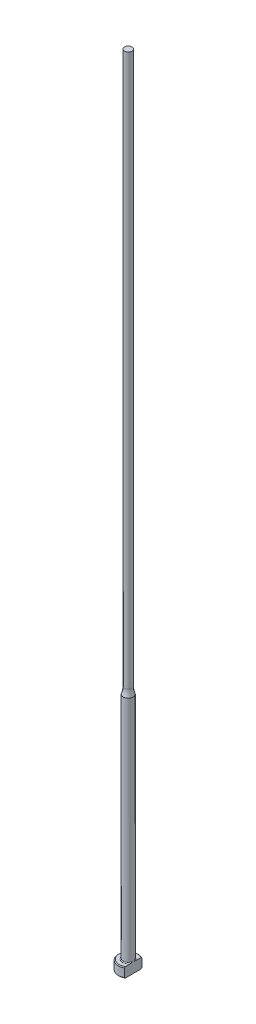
ISO-10303-21;
HEADER;
FILE_DESCRIPTION(('STEP AP214'),'2;1');
FILE_NAME('part.step','',(''),(''),'','','');
FILE_SCHEMA(('AUTOMOTIVE_DESIGN { 1 0 10303 214 1 1 1 1 }'));
ENDSEC;
DATA;
#1=APPLICATION_CONTEXT('core data for automotive mechanical design processes');
#2=APPLICATION_PROTOCOL_DEFINITION('international standard','automotive_design',2000,#1);
#3=PRODUCT_CONTEXT('',#1,'mechanical');
#4=PRODUCT('Part','Part','',(#3));
#5=PRODUCT_RELATED_PRODUCT_CATEGORY('part','',(#4));
#6=PRODUCT_DEFINITION_FORMATION('','',#4);
#7=PRODUCT_DEFINITION_CONTEXT('part definition',#1,'design');
#8=PRODUCT_DEFINITION('design','',#6,#7);
#9=PRODUCT_DEFINITION_SHAPE('','',#8);
#10=(LENGTH_UNIT() NAMED_UNIT(*) SI_UNIT(.MILLI.,.METRE.));
#11=(NAMED_UNIT(*) PLANE_ANGLE_UNIT() SI_UNIT($,.RADIAN.));
#12=(NAMED_UNIT(*) SI_UNIT($,.STERADIAN.) SOLID_ANGLE_UNIT());
#13=UNCERTAINTY_MEASURE_WITH_UNIT(LENGTH_MEASURE(1.E-05),#10,'distance_accuracy_value','');
#14=(GEOMETRIC_REPRESENTATION_CONTEXT(3) GLOBAL_UNCERTAINTY_ASSIGNED_CONTEXT((#13)) GLOBAL_UNIT_ASSIGNED_CONTEXT((#10,
#11,#12)) REPRESENTATION_CONTEXT('',''));
#15=CARTESIAN_POINT('',(0.,0.,0.));
#16=DIRECTION('',(0.,0.,1.));
#17=DIRECTION('',(1.,0.,0.));
#18=AXIS2_PLACEMENT_3D('',#15,#16,#17);
#19=CARTESIAN_POINT('',(-3.17499999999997,3.175,0.));
#20=DIRECTION('',(0.,1.,0.));
#21=DIRECTION('',(0.,0.,1.));
#22=AXIS2_PLACEMENT_3D('',#19,#20,#21);
#23=PLANE('',#22);
#24=CARTESIAN_POINT('',(0.,3.175,0.));
#25=DIRECTION('',(0.,1.,0.));
#26=DIRECTION('',(0.,0.,1.));
#27=AXIS2_PLACEMENT_3D('',#24,#25,#26);
#28=CIRCLE('',#27,2.92099999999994);
#29=CARTESIAN_POINT('',(1.58749999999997,3.175,-2.45195529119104));
#30=VERTEX_POINT('',#29);
#31=CARTESIAN_POINT('',(1.58749999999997,3.175,2.45195529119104));
#32=VERTEX_POINT('',#31);
#33=EDGE_CURVE('E105',#30,#32,#28,.T.);
#34=ORIENTED_EDGE('',*,*,#33,.T.);
#35=DIRECTION('',(0.,0.,1.));
#36=VECTOR('',#35,1.);
#37=CARTESIAN_POINT('',(1.58749999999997,3.17499999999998,2.74963065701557));
#38=LINE('',#37,#36);
#39=CARTESIAN_POINT('',(1.58749999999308,3.175,0.933255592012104));
#40=VERTEX_POINT('',#39);
#41=EDGE_CURVE('E126',#40,#32,#38,.T.);
#42=ORIENTED_EDGE('',*,*,#41,.F.);
#43=CARTESIAN_POINT('',(0.,3.175,0.));
#44=DIRECTION('',(0.,1.,0.));
#45=DIRECTION('',(0.,0.,1.));
#46=AXIS2_PLACEMENT_3D('',#43,#44,#45);
#47=CIRCLE('',#46,1.84149999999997);
#48=CARTESIAN_POINT('',(1.58749999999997,3.17500000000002,-0.933255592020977));
#49=VERTEX_POINT('',#48);
#50=EDGE_CURVE('E11',#40,#49,#47,.F.);
#51=ORIENTED_EDGE('',*,*,#50,.T.);
#52=EDGE_CURVE('E52',#30,#49,#38,.T.);
#53=ORIENTED_EDGE('',*,*,#52,.F.);
#54=EDGE_LOOP('',(#34,#42,#51,#53));
#55=FACE_BOUND('',#54,.T.);
#56=ADVANCED_FACE('F32',(#55),#23,.T.);
#57=CARTESIAN_POINT('',(0.,259.958771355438,0.));
#58=DIRECTION('',(0.,1.,0.));
#59=DIRECTION('',(0.,0.,1.));
#60=AXIS2_PLACEMENT_3D('',#57,#58,#59);
#61=CYLINDRICAL_SURFACE('',#60,3.17499999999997);
#62=CARTESIAN_POINT('',(0.,2.92100000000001,0.));
#63=DIRECTION('',(0.,1.,0.));
#64=DIRECTION('',(0.,0.,1.));
#65=AXIS2_PLACEMENT_3D('',#62,#63,#64);
#66=CIRCLE('',#65,3.17499999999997);
#67=CARTESIAN_POINT('',(1.58749999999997,2.92100000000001,2.74963065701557));
#68=VERTEX_POINT('',#67);
#69=CARTESIAN_POINT('',(1.58749999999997,2.92100000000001,-2.74963065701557));
#70=VERTEX_POINT('',#69);
#71=EDGE_CURVE('E98',#68,#70,#66,.F.);
#72=ORIENTED_EDGE('',*,*,#71,.T.);
#73=DIRECTION('',(0.,-1.,0.));
#74=VECTOR('',#73,1.);
#75=CARTESIAN_POINT('',(1.58749999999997,254.001,-2.74963065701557));
#76=LINE('',#75,#74);
#77=CARTESIAN_POINT('',(1.58749999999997,0.253999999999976,-2.74963065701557));
#78=VERTEX_POINT('',#77);
#79=EDGE_CURVE('E141',#70,#78,#76,.T.);
#80=ORIENTED_EDGE('',*,*,#79,.T.);
#81=CARTESIAN_POINT('',(0.,0.253999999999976,0.));
#82=DIRECTION('',(0.,-1.,0.));
#83=DIRECTION('',(0.,0.,-1.));
#84=AXIS2_PLACEMENT_3D('',#81,#82,#83);
#85=CIRCLE('',#84,3.17499999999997);
#86=CARTESIAN_POINT('',(1.58749999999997,0.253999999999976,2.74963065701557));
#87=VERTEX_POINT('',#86);
#88=EDGE_CURVE('E95',#78,#87,#85,.F.);
#89=ORIENTED_EDGE('',*,*,#88,.T.);
#90=DIRECTION('',(0.,-1.,0.));
#91=VECTOR('',#90,1.);
#92=CARTESIAN_POINT('',(1.58749999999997,254.001,2.74963065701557));
#93=LINE('',#92,#91);
#94=EDGE_CURVE('E88',#68,#87,#93,.T.);
#95=ORIENTED_EDGE('',*,*,#94,.F.);
#96=EDGE_LOOP('',(#72,#80,#89,#95));
#97=FACE_BOUND('',#96,.T.);
#98=ADVANCED_FACE('F191',(#97),#61,.T.);
#99=CARTESIAN_POINT('',(0.,0.,0.));
#100=DIRECTION('',(0.,-1.,0.));
#101=DIRECTION('',(0.,0.,-1.));
#102=AXIS2_PLACEMENT_3D('',#99,#100,#101);
#103=PLANE('',#102);
#104=CARTESIAN_POINT('',(0.,0.,0.));
#105=DIRECTION('',(0.,-1.,0.));
#106=DIRECTION('',(0.,0.,-1.));
#107=AXIS2_PLACEMENT_3D('',#104,#105,#106);
#108=CIRCLE('',#107,2.92100000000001);
#109=CARTESIAN_POINT('',(1.58749999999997,0.,2.45195529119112));
#110=VERTEX_POINT('',#109);
#111=CARTESIAN_POINT('',(1.58749999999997,0.,-2.45195529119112));
#112=VERTEX_POINT('',#111);
#113=EDGE_CURVE('E93',#110,#112,#108,.T.);
#114=ORIENTED_EDGE('',*,*,#113,.T.);
#115=DIRECTION('',(0.,0.,1.));
#116=VECTOR('',#115,1.);
#117=CARTESIAN_POINT('',(1.58749999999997,0.,2.74963065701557));
#118=LINE('',#117,#116);
#119=EDGE_CURVE('E78',#112,#110,#118,.T.);
#120=ORIENTED_EDGE('',*,*,#119,.T.);
#121=EDGE_LOOP('',(#114,#120));
#122=FACE_BOUND('',#121,.T.);
#123=ADVANCED_FACE('F97',(#122),#103,.T.);
#124=CARTESIAN_POINT('',(0.,3.17499999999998,0.));
#125=DIRECTION('',(0.,-1.,0.));
#126=DIRECTION('',(0.,0.,-1.));
#127=AXIS2_PLACEMENT_3D('',#124,#125,#126);
#128=CONICAL_SURFACE('',#127,2.92099999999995,0.785398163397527);
#129=ORIENTED_EDGE('',*,*,#71,.F.);
#130=CARTESIAN_POINT('',(1.58749999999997,-0.16162066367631,-6.0529050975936));
#131=CARTESIAN_POINT('',(1.58749999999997,-0.0288893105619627,-5.91567682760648));
#132=CARTESIAN_POINT('',(1.58749999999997,0.103699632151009,-5.7783103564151));
#133=CARTESIAN_POINT('',(1.58749999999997,0.368508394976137,-5.50321874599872));
#134=CARTESIAN_POINT('',(1.58749999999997,0.500728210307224,-5.36549360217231));
#135=CARTESIAN_POINT('',(1.58749999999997,0.764778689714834,-5.08953516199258));
#136=CARTESIAN_POINT('',(1.58749999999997,0.896609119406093,-4.9513016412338));
#137=CARTESIAN_POINT('',(1.58749999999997,1.15968706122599,-4.67428233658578));
#138=CARTESIAN_POINT('',(1.58749999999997,1.29093457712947,-4.53549655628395));
#139=CARTESIAN_POINT('',(1.58749999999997,1.55007705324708,-4.25997724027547));
#140=CARTESIAN_POINT('',(1.58749999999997,1.67798684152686,-4.12325766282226));
#141=CARTESIAN_POINT('',(1.58749999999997,1.9328486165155,-3.84892898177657));
#142=CARTESIAN_POINT('',(1.58749999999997,2.05980060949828,-3.71131988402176));
#143=CARTESIAN_POINT('',(1.58749999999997,2.31237508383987,-3.43493978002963));
#144=CARTESIAN_POINT('',(1.58749999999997,2.43799784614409,-3.29616903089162));
#145=CARTESIAN_POINT('',(1.58749999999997,2.68741369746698,-3.01699558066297));
#146=CARTESIAN_POINT('',(1.58749999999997,2.81120686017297,-2.8765929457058));
#147=CARTESIAN_POINT('',(1.58749999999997,3.00875865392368,-2.64816703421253));
#148=CARTESIAN_POINT('',(1.58749999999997,3.08336151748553,-2.56087478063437));
#149=CARTESIAN_POINT('',(1.58749999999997,3.2312387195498,-2.38515423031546));
#150=CARTESIAN_POINT('',(1.58749999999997,3.30451292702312,-2.29672582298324));
#151=CARTESIAN_POINT('',(1.58749999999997,3.45004422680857,-2.1174740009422));
#152=CARTESIAN_POINT('',(1.58749999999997,3.5222823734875,-2.02663514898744));
#153=CARTESIAN_POINT('',(1.58749999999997,3.66423097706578,-1.8430252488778));
#154=CARTESIAN_POINT('',(1.58749999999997,3.73394203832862,-1.75025467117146));
#155=CARTESIAN_POINT('',(1.58749999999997,3.87080633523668,-1.5606747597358));
#156=CARTESIAN_POINT('',(1.58749999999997,3.93790459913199,-1.46382547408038));
#157=CARTESIAN_POINT('',(1.58749999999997,4.06669147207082,-1.26632594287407));
#158=CARTESIAN_POINT('',(1.58749999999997,4.1283726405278,-1.16567073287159));
#159=CARTESIAN_POINT('',(1.58749999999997,4.21402252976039,-1.01165766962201));
#160=CARTESIAN_POINT('',(1.58749999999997,4.24127929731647,-0.960142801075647));
#161=CARTESIAN_POINT('',(1.58749999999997,4.2930979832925,-0.855780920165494));
#162=CARTESIAN_POINT('',(1.58749999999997,4.31765941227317,-0.802933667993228));
#163=CARTESIAN_POINT('',(1.58749999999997,4.38614656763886,-0.642461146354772));
#164=CARTESIAN_POINT('',(1.58749999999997,4.42510149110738,-0.532518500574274));
#165=CARTESIAN_POINT('',(1.58749999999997,4.46726244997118,-0.367680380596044));
#166=CARTESIAN_POINT('',(1.58749999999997,4.47844427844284,-0.314802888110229));
#167=CARTESIAN_POINT('',(1.58749999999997,4.49576654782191,-0.208209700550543));
#168=CARTESIAN_POINT('',(1.58749999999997,4.50190743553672,-0.154494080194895));
#169=CARTESIAN_POINT('',(1.58749999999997,4.50871296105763,-0.0468792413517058));
#170=CARTESIAN_POINT('',(1.58749999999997,4.5093945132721,0.00701889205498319));
#171=CARTESIAN_POINT('',(1.58749999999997,4.50527679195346,0.114606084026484));
#172=CARTESIAN_POINT('',(1.58749999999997,4.50047706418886,0.168295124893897));
#173=CARTESIAN_POINT('',(1.58749999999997,4.48579689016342,0.27448544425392));
#174=CARTESIAN_POINT('',(1.58749999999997,4.47596081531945,0.32699298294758));
#175=CARTESIAN_POINT('',(1.58749999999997,4.45181809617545,0.430974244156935));
#176=CARTESIAN_POINT('',(1.58749999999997,4.4375096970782,0.482447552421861));
#177=CARTESIAN_POINT('',(1.58749999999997,4.40502489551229,0.584460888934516));
#178=CARTESIAN_POINT('',(1.58749999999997,4.386827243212,0.634994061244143));
#179=CARTESIAN_POINT('',(1.58749999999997,4.34729308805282,0.734789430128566));
#180=CARTESIAN_POINT('',(1.58749999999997,4.3259572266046,0.784051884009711));
#181=CARTESIAN_POINT('',(1.58749999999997,4.25791922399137,0.930549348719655));
#182=CARTESIAN_POINT('',(1.58749999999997,4.20736047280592,1.0259880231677));
#183=CARTESIAN_POINT('',(1.58749999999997,4.0995545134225,1.21304313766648));
#184=CARTESIAN_POINT('',(1.58749999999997,4.04229912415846,1.30465471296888));
#185=CARTESIAN_POINT('',(1.58749999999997,3.92308746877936,1.48526211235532));
#186=CARTESIAN_POINT('',(1.58749999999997,3.86111349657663,1.57424615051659));
#187=CARTESIAN_POINT('',(1.58749999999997,3.73408621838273,1.74990003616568));
#188=CARTESIAN_POINT('',(1.58749999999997,3.66903444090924,1.83657099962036));
#189=CARTESIAN_POINT('',(1.58749999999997,3.53583371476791,2.00931764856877));
#190=CARTESIAN_POINT('',(1.58749999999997,3.46765527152,2.09537048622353));
#191=CARTESIAN_POINT('',(1.58749999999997,3.32960643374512,2.26611736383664));
#192=CARTESIAN_POINT('',(1.58749999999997,3.25973586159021,2.35081125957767));
#193=CARTESIAN_POINT('',(1.58749999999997,3.04858139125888,2.60290121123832));
#194=CARTESIAN_POINT('',(1.58749999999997,2.90542388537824,2.76872537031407));
#195=CARTESIAN_POINT('',(1.58749999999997,2.64069522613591,3.06970913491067));
#196=CARTESIAN_POINT('',(1.58749999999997,2.51959458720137,3.20528660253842));
#197=CARTESIAN_POINT('',(1.58749999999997,2.27590400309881,3.47510321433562));
#198=CARTESIAN_POINT('',(1.58749999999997,2.15331401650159,3.60934232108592));
#199=CARTESIAN_POINT('',(1.58749999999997,1.90694239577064,3.87695374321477));
#200=CARTESIAN_POINT('',(1.58749999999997,1.78315974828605,4.0103251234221));
#201=CARTESIAN_POINT('',(1.58749999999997,1.53478104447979,4.27630880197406));
#202=CARTESIAN_POINT('',(1.58749999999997,1.41018498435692,4.40892109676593));
#203=CARTESIAN_POINT('',(1.58749999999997,1.0457468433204,4.79499418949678));
#204=CARTESIAN_POINT('',(1.58749999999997,0.80507680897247,5.04767313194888));
#205=CARTESIAN_POINT('',(1.58749999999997,0.443121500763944,5.42550911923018));
#206=CARTESIAN_POINT('',(1.58749999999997,0.322378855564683,5.55118772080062));
#207=CARTESIAN_POINT('',(1.58749999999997,0.0805914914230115,5.80225207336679));
#208=CARTESIAN_POINT('',(1.58749999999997,-0.040453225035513,5.92763782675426));
#209=CARTESIAN_POINT('',(1.58749999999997,-0.161620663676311,6.0529050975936));
#210=B_SPLINE_CURVE_WITH_KNOTS('',3,(#130,#131,#132,#133,#134,#135,#136,#137,#138,#139,#140,
#141,#142,#143,#144,#145,#146,#147,#148,#149,#150,#151,#152,#153,#154,#155,#156,#157,#158,#159,
#160,#161,#162,#163,#164,#165,#166,#167,#168,#169,#170,#171,#172,#173,#174,#175,#176,#177,#178,
#179,#180,#181,#182,#183,#184,#185,#186,#187,#188,#189,#190,#191,#192,#193,#194,#195,#196,#197,
#198,#199,#200,#201,#202,#203,#204,#205,#206,#207,#208,#209),.UNSPECIFIED.,.F.,.F.,(4,2,2,2,2,2,
2,2,2,2,2,2,2,2,2,2,2,2,2,2,2,2,2,2,2,2,2,2,2,2,2,2,2,2,2,2,2,2,2,4),(0.,0.572750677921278,
1.14550874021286,1.71856057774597,2.29160869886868,2.85328006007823,3.4149477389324,
3.97649423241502,4.53801804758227,4.88249307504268,5.22700189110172,5.5751532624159,
5.92322081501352,6.27657800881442,6.63041319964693,6.80518126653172,6.9799810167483,
7.3282426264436,7.49018491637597,7.65211285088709,7.81353889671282,7.97497832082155,
8.13501929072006,8.29512313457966,8.45612518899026,8.61709438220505,8.94062993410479,
9.2645649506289,9.58978187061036,9.91483894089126,10.2441741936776,10.5735441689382,
11.2306812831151,11.7760337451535,12.3214014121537,12.8672825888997,13.4131663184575,
14.4600164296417,14.9828595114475,15.5056983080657),.UNSPECIFIED.);
#211=EDGE_CURVE('E118',#32,#68,#210,.T.);
#212=ORIENTED_EDGE('',*,*,#211,.F.);
#213=ORIENTED_EDGE('',*,*,#33,.F.);
#214=EDGE_CURVE('E117',#70,#30,#210,.T.);
#215=ORIENTED_EDGE('',*,*,#214,.F.);
#216=EDGE_LOOP('',(#129,#212,#213,#215));
#217=FACE_BOUND('',#216,.T.);
#218=ADVANCED_FACE('F162',(#217),#128,.T.);
#219=CARTESIAN_POINT('',(0.,0.253999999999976,0.));
#220=DIRECTION('',(0.,1.,0.));
#221=DIRECTION('',(0.,0.,1.));
#222=AXIS2_PLACEMENT_3D('',#219,#220,#221);
#223=CONICAL_SURFACE('',#222,3.17499999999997,0.785398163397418);
#224=ORIENTED_EDGE('',*,*,#88,.F.);
#225=CARTESIAN_POINT('',(1.58749999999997,3.33662066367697,6.0529050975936));
#226=CARTESIAN_POINT('',(1.58749999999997,3.20388931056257,5.91567682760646));
#227=CARTESIAN_POINT('',(1.58749999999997,3.07130036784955,5.77831035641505));
#228=CARTESIAN_POINT('',(1.58749999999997,2.80649160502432,5.50321874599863));
#229=CARTESIAN_POINT('',(1.58749999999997,2.67427178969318,5.3654936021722));
#230=CARTESIAN_POINT('',(1.58749999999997,2.41022131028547,5.08953516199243));
#231=CARTESIAN_POINT('',(1.58749999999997,2.27839088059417,4.95130164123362));
#232=CARTESIAN_POINT('',(1.58749999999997,2.01531293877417,4.67428233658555));
#233=CARTESIAN_POINT('',(1.58749999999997,1.88406542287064,4.5354965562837));
#234=CARTESIAN_POINT('',(1.58749999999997,1.62492294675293,4.25997724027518));
#235=CARTESIAN_POINT('',(1.58749999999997,1.49701315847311,4.12325766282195));
#236=CARTESIAN_POINT('',(1.58749999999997,1.24215138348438,3.84892898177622));
#237=CARTESIAN_POINT('',(1.58749999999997,1.11519939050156,3.71131988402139));
#238=CARTESIAN_POINT('',(1.58749999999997,0.862624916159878,3.43493978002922));
#239=CARTESIAN_POINT('',(1.58749999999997,0.737002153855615,3.29616903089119));
#240=CARTESIAN_POINT('',(1.58749999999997,0.487586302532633,3.01699558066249));
#241=CARTESIAN_POINT('',(1.58749999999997,0.363793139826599,2.8765929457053));
#242=CARTESIAN_POINT('',(1.58749999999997,0.166241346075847,2.64816703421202));
#243=CARTESIAN_POINT('',(1.58749999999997,0.0916384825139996,2.56087478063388));
#244=CARTESIAN_POINT('',(1.58749999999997,-0.0562387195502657,2.385154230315));
#245=CARTESIAN_POINT('',(1.58749999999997,-0.129512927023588,2.29672582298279));
#246=CARTESIAN_POINT('',(1.58749999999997,-0.27504422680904,2.11747400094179));
#247=CARTESIAN_POINT('',(1.58749999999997,-0.347282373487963,2.02663514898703));
#248=CARTESIAN_POINT('',(1.58749999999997,-0.489230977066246,1.84302524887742));
#249=CARTESIAN_POINT('',(1.58749999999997,-0.558942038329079,1.7502546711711));
#250=CARTESIAN_POINT('',(1.58749999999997,-0.695806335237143,1.56067475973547));
#251=CARTESIAN_POINT('',(1.58749999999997,-0.762904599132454,1.46382547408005));
#252=CARTESIAN_POINT('',(1.58749999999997,-0.891691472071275,1.26632594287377));
#253=CARTESIAN_POINT('',(1.58749999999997,-0.953372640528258,1.16567073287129));
#254=CARTESIAN_POINT('',(1.58749999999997,-1.03902252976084,1.01165766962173));
#255=CARTESIAN_POINT('',(1.58749999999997,-1.06627929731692,0.960142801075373));
#256=CARTESIAN_POINT('',(1.58749999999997,-1.11809798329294,0.85578092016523));
#257=CARTESIAN_POINT('',(1.58749999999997,-1.14265941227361,0.802933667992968));
#258=CARTESIAN_POINT('',(1.58749999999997,-1.21114656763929,0.642461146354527));
#259=CARTESIAN_POINT('',(1.58749999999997,-1.2501014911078,0.532518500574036));
#260=CARTESIAN_POINT('',(1.58749999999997,-1.29226244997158,0.367680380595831));
#261=CARTESIAN_POINT('',(1.58749999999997,-1.30344427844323,0.314802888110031));
#262=CARTESIAN_POINT('',(1.58749999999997,-1.32076654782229,0.208209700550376));
#263=CARTESIAN_POINT('',(1.58749999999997,-1.3269074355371,0.154494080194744));
#264=CARTESIAN_POINT('',(1.58749999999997,-1.333712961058,0.0468792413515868));
#265=CARTESIAN_POINT('',(1.58749999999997,-1.33439451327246,-0.00701889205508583));
#266=CARTESIAN_POINT('',(1.58749999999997,-1.33027679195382,-0.114606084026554));
#267=CARTESIAN_POINT('',(1.58749999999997,-1.32547706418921,-0.168295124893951));
#268=CARTESIAN_POINT('',(1.58749999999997,-1.31079689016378,-0.274485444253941));
#269=CARTESIAN_POINT('',(1.58749999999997,-1.3009608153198,-0.326992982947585));
#270=CARTESIAN_POINT('',(1.58749999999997,-1.27681809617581,-0.430974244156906));
#271=CARTESIAN_POINT('',(1.58749999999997,-1.26250969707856,-0.482447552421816));
#272=CARTESIAN_POINT('',(1.58749999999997,-1.23002489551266,-0.584460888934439));
#273=CARTESIAN_POINT('',(1.58749999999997,-1.21182724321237,-0.634994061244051));
#274=CARTESIAN_POINT('',(1.58749999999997,-1.1722930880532,-0.734789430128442));
#275=CARTESIAN_POINT('',(1.58749999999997,-1.15095722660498,-0.784051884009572));
#276=CARTESIAN_POINT('',(1.58749999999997,-1.08291922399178,-0.93054934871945));
#277=CARTESIAN_POINT('',(1.58749999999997,-1.03236047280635,-1.02598802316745));
#278=CARTESIAN_POINT('',(1.58749999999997,-0.924554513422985,-1.21304313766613));
#279=CARTESIAN_POINT('',(1.58749999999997,-0.86729912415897,-1.30465471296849));
#280=CARTESIAN_POINT('',(1.58749999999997,-0.748087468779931,-1.48526211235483));
#281=CARTESIAN_POINT('',(1.58749999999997,-0.686113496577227,-1.57424615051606));
#282=CARTESIAN_POINT('',(1.58749999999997,-0.55908621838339,-1.74990003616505));
#283=CARTESIAN_POINT('',(1.58749999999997,-0.494034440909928,-1.83657099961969));
#284=CARTESIAN_POINT('',(1.58749999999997,-0.360833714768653,-2.00931764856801));
#285=CARTESIAN_POINT('',(1.58749999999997,-0.292655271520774,-2.09537048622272));
#286=CARTESIAN_POINT('',(1.58749999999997,-0.154606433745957,-2.26611736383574));
#287=CARTESIAN_POINT('',(1.58749999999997,-0.0847358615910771,-2.35081125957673));
#288=CARTESIAN_POINT('',(1.58749999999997,0.126418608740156,-2.60290121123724));
#289=CARTESIAN_POINT('',(1.58749999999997,0.269576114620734,-2.76872537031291));
#290=CARTESIAN_POINT('',(1.58749999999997,0.534304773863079,-3.06970913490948));
#291=CARTESIAN_POINT('',(1.58749999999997,0.655405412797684,-3.20528660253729));
#292=CARTESIAN_POINT('',(1.58749999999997,0.899095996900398,-3.47510321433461));
#293=CARTESIAN_POINT('',(1.58749999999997,1.02168598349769,-3.60934232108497));
#294=CARTESIAN_POINT('',(1.58749999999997,1.26805760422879,-3.87695374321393));
#295=CARTESIAN_POINT('',(1.58749999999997,1.39184025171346,-4.01032512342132));
#296=CARTESIAN_POINT('',(1.58749999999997,1.64021895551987,-4.2763088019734));
#297=CARTESIAN_POINT('',(1.58749999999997,1.76481501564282,-4.40892109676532));
#298=CARTESIAN_POINT('',(1.58749999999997,2.12925315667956,-4.79499418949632));
#299=CARTESIAN_POINT('',(1.58749999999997,2.36992319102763,-5.04767313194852));
#300=CARTESIAN_POINT('',(1.58749999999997,2.73187849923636,-5.42550911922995));
#301=CARTESIAN_POINT('',(1.58749999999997,2.85262114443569,-5.55118772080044));
#302=CARTESIAN_POINT('',(1.58749999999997,3.09440850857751,-5.8022520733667));
#303=CARTESIAN_POINT('',(1.58749999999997,3.2154532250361,-5.92763782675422));
#304=CARTESIAN_POINT('',(1.58749999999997,3.33662066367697,-6.0529050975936));
#305=B_SPLINE_CURVE_WITH_KNOTS('',3,(#225,#226,#227,#228,#229,#230,#231,#232,#233,#234,#235,
#236,#237,#238,#239,#240,#241,#242,#243,#244,#245,#246,#247,#248,#249,#250,#251,#252,#253,#254,
#255,#256,#257,#258,#259,#260,#261,#262,#263,#264,#265,#266,#267,#268,#269,#270,#271,#272,#273,
#274,#275,#276,#277,#278,#279,#280,#281,#282,#283,#284,#285,#286,#287,#288,#289,#290,#291,#292,
#293,#294,#295,#296,#297,#298,#299,#300,#301,#302,#303,#304),.UNSPECIFIED.,.F.,.F.,(4,2,2,2,2,2,
2,2,2,2,2,2,2,2,2,2,2,2,2,2,2,2,2,2,2,2,2,2,2,2,2,2,2,2,2,2,2,2,2,4),(0.,0.57275067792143,
1.14550874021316,1.71856057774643,2.29160869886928,2.85328006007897,3.41494773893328,
3.97649423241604,4.53801804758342,4.88249307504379,5.2270018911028,5.57515326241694,
5.92322081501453,6.27657800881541,6.63041319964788,6.80518126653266,6.97998101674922,
7.32824262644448,7.49018491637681,7.65211285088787,7.81353889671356,7.97497832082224,
8.1350192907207,8.29512313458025,8.45612518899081,8.61709438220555,8.94062993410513,
9.26456495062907,9.58978187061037,9.91483894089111,10.2441741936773,10.5735441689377,
11.2306812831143,11.776033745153,12.3214014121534,12.8672825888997,13.4131663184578,
14.4600164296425,14.9828595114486,15.505698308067),.UNSPECIFIED.);
#306=EDGE_CURVE('E81',#112,#78,#305,.T.);
#307=ORIENTED_EDGE('',*,*,#306,.F.);
#308=ORIENTED_EDGE('',*,*,#113,.F.);
#309=EDGE_CURVE('E84',#87,#110,#305,.T.);
#310=ORIENTED_EDGE('',*,*,#309,.F.);
#311=EDGE_LOOP('',(#224,#307,#308,#310));
#312=FACE_BOUND('',#311,.T.);
#313=ADVANCED_FACE('F92',(#312),#223,.T.);
#314=CARTESIAN_POINT('',(0.,3.42900000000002,0.));
#315=DIRECTION('',(0.,1.,0.));
#316=DIRECTION('',(0.,0.,1.));
#317=AXIS2_PLACEMENT_3D('',#314,#315,#316);
#318=TOROIDAL_SURFACE('',#317,1.84149999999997,0.254);
#319=CARTESIAN_POINT('',(1.58749999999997,3.42900000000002,0.));
#320=CARTESIAN_POINT('',(1.58749999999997,3.42899942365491,-1.9220514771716E-10));
#321=CARTESIAN_POINT('',(1.58749999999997,3.42899884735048,-1.2261161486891E-07));
#322=CARTESIAN_POINT('',(1.58749999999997,3.42899773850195,-5.09676365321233E-07));
#323=CARTESIAN_POINT('',(1.58749999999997,3.42899720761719,-7.78176328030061E-07));
#324=CARTESIAN_POINT('',(1.58749999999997,3.42899614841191,-1.42307272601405E-06));
#325=CARTESIAN_POINT('',(1.58749999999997,3.42899562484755,-1.80713867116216E-06));
#326=CARTESIAN_POINT('',(1.58749999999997,3.42899463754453,-2.63494846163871E-06));
#327=CARTESIAN_POINT('',(1.58749999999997,3.42899417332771,-3.07814756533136E-06));
#328=CARTESIAN_POINT('',(1.58749999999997,3.42899261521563,-4.66897357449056E-06));
#329=CARTESIAN_POINT('',(1.58749999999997,3.42899159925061,-5.89404908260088E-06));
#330=CARTESIAN_POINT('',(1.58749999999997,3.42898979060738,-8.42427511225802E-06));
#331=CARTESIAN_POINT('',(1.58749999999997,3.42898899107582,-9.7248057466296E-06));
#332=CARTESIAN_POINT('',(1.58749999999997,3.42898598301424,-1.48060601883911E-05));
#333=CARTESIAN_POINT('',(1.58749999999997,3.42898393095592,-1.86838281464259E-05));
#334=CARTESIAN_POINT('',(1.58749999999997,3.42898057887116,-2.63261117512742E-05));
#335=CARTESIAN_POINT('',(1.58749999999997,3.42897922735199,-3.00687417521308E-05));
#336=CARTESIAN_POINT('',(1.58749999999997,3.42897347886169,-4.60276298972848E-05));
#337=CARTESIAN_POINT('',(1.58749999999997,3.42896911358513,-5.8247019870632E-05));
#338=CARTESIAN_POINT('',(1.58749999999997,3.42896211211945,-8.11070097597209E-05));
#339=CARTESIAN_POINT('',(1.58749999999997,3.42895931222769,-9.16953114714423E-05));
#340=CARTESIAN_POINT('',(1.58749999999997,3.42893712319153,-0.000168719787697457));
#341=CARTESIAN_POINT('',(1.58749999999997,3.42890881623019,-0.000232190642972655));
#342=CARTESIAN_POINT('',(1.58749999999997,3.42880276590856,-0.000479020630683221));
#343=CARTESIAN_POINT('',(1.58749999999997,3.42873165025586,-0.00066443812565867));
#344=CARTESIAN_POINT('',(1.58749999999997,3.42845137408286,-0.0013844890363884));
#345=CARTESIAN_POINT('',(1.58749999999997,3.42823526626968,-0.00191701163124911));
#346=CARTESIAN_POINT('',(1.58749999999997,3.42735449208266,-0.00409774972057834));
#347=CARTESIAN_POINT('',(1.58749999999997,3.42669768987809,-0.00574830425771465));
#348=CARTESIAN_POINT('',(1.58749999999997,3.4174405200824,-0.0289985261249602));
#349=CARTESIAN_POINT('',(1.58749999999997,3.40878325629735,-0.0505816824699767));
#350=CARTESIAN_POINT('',(1.58749999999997,3.39189297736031,-0.0929947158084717));
#351=CARTESIAN_POINT('',(1.58749999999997,3.38365605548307,-0.11382315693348));
#352=CARTESIAN_POINT('',(1.58749999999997,3.36635393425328,-0.157956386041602));
#353=CARTESIAN_POINT('',(1.58749999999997,3.35730391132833,-0.181267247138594));
#354=CARTESIAN_POINT('',(1.58749999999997,3.33936775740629,-0.228222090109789));
#355=CARTESIAN_POINT('',(1.58749999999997,3.33048420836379,-0.25186705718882));
#356=CARTESIAN_POINT('',(1.58749999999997,3.30894496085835,-0.310512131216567));
#357=CARTESIAN_POINT('',(1.58749999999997,3.29649449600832,-0.345588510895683));
#358=CARTESIAN_POINT('',(1.58749999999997,3.27296975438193,-0.415278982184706));
#359=CARTESIAN_POINT('',(1.58749999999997,3.26186987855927,-0.449884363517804));
#360=CARTESIAN_POINT('',(1.58749999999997,3.2395832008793,-0.524471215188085));
#361=CARTESIAN_POINT('',(1.58749999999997,3.22860862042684,-0.564517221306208));
#362=CARTESIAN_POINT('',(1.58749999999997,3.20902534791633,-0.645529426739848));
#363=CARTESIAN_POINT('',(1.58749999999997,3.20043582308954,-0.686500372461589));
#364=CARTESIAN_POINT('',(1.58749999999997,3.18611712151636,-0.771546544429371));
#365=CARTESIAN_POINT('',(1.58749999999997,3.18059550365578,-0.815658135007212));
#366=CARTESIAN_POINT('',(1.58749999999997,3.17455396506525,-0.904117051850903));
#367=CARTESIAN_POINT('',(1.58749999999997,3.17401361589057,-0.948462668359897));
#368=CARTESIAN_POINT('',(1.58749999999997,3.17898948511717,-1.02531896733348));
#369=CARTESIAN_POINT('',(1.58749999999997,3.1829739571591,-1.05792141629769));
#370=CARTESIAN_POINT('',(1.58749999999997,3.19569167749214,-1.12184393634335));
#371=CARTESIAN_POINT('',(1.58749999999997,3.20436049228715,-1.1531753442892));
#372=CARTESIAN_POINT('',(1.58749999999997,3.22236152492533,-1.19946468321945));
#373=CARTESIAN_POINT('',(1.58749999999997,3.2295150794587,-1.21526783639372));
#374=CARTESIAN_POINT('',(1.58749999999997,3.24587062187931,-1.24583726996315));
#375=CARTESIAN_POINT('',(1.58749999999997,3.25507530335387,-1.26060215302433));
#376=CARTESIAN_POINT('',(1.58749999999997,3.27378481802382,-1.28575815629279));
#377=CARTESIAN_POINT('',(1.58749999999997,3.28289001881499,-1.29644383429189));
#378=CARTESIAN_POINT('',(1.58749999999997,3.30268460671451,-1.31623154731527));
#379=CARTESIAN_POINT('',(1.58749999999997,3.31337067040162,-1.32533681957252));
#380=CARTESIAN_POINT('',(1.58749999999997,3.33349977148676,-1.33941140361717));
#381=CARTESIAN_POINT('',(1.58749999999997,3.34261446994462,-1.34484814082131));
#382=CARTESIAN_POINT('',(1.58749999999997,3.36161455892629,-1.35416329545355));
#383=CARTESIAN_POINT('',(1.58749999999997,3.37149946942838,-1.35804267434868));
#384=CARTESIAN_POINT('',(1.58749999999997,3.39188678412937,-1.36398436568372));
#385=CARTESIAN_POINT('',(1.58749999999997,3.40239309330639,-1.36603350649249));
#386=CARTESIAN_POINT('',(1.58749999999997,3.42360372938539,-1.3680840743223));
#387=CARTESIAN_POINT('',(1.58749999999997,3.43430795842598,-1.36808648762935));
#388=CARTESIAN_POINT('',(1.58749999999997,3.45433283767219,-1.36616208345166));
#389=CARTESIAN_POINT('',(1.58749999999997,3.46367506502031,-1.36444960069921));
#390=CARTESIAN_POINT('',(1.58749999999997,3.48195519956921,-1.35953338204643));
#391=CARTESIAN_POINT('',(1.58749999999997,3.49089304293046,-1.3563294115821));
#392=CARTESIAN_POINT('',(1.58749999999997,3.50850302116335,-1.34848006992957));
#393=CARTESIAN_POINT('',(1.58749999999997,3.5171531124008,-1.34378578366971));
#394=CARTESIAN_POINT('',(1.58749999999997,3.53371257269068,-1.33324445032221));
#395=CARTESIAN_POINT('',(1.58749999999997,3.54162163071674,-1.32739692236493));
#396=CARTESIAN_POINT('',(1.58749999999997,3.56107121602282,-1.31107304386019));
#397=CARTESIAN_POINT('',(1.58749999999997,3.57202221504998,-1.29989286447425));
#398=CARTESIAN_POINT('',(1.58749999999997,3.59202509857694,-1.27593566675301));
#399=CARTESIAN_POINT('',(1.58749999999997,3.60107086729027,-1.26315370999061));
#400=CARTESIAN_POINT('',(1.58749999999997,3.62186023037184,-1.22930733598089));
#401=CARTESIAN_POINT('',(1.58749999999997,3.63240584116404,-1.20751096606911));
#402=CARTESIAN_POINT('',(1.58749999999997,3.65004643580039,-1.16266144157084));
#403=CARTESIAN_POINT('',(1.58749999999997,3.65714435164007,-1.13960937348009));
#404=CARTESIAN_POINT('',(1.58749999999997,3.67265428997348,-1.07603916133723));
#405=CARTESIAN_POINT('',(1.58749999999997,3.67834921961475,-1.03486686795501));
#406=CARTESIAN_POINT('',(1.58749999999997,3.68382880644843,-0.951558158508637));
#407=CARTESIAN_POINT('',(1.58749999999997,3.68350976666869,-0.909417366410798));
#408=CARTESIAN_POINT('',(1.58749999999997,3.67745397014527,-0.811383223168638));
#409=CARTESIAN_POINT('',(1.58749999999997,3.66993873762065,-0.755610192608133));
#410=CARTESIAN_POINT('',(1.58749999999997,3.64933373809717,-0.644937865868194));
#411=CARTESIAN_POINT('',(1.58749999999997,3.63621897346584,-0.59004364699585));
#412=CARTESIAN_POINT('',(1.58749999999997,3.60740922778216,-0.485757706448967));
#413=CARTESIAN_POINT('',(1.58749999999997,3.59201096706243,-0.436281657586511));
#414=CARTESIAN_POINT('',(1.58749999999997,3.55922497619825,-0.338551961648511));
#415=CARTESIAN_POINT('',(1.58749999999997,3.5418584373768,-0.290291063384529));
#416=CARTESIAN_POINT('',(1.58749999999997,3.51760237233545,-0.225557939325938));
#417=CARTESIAN_POINT('',(1.58749999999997,3.51126413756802,-0.208874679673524));
#418=CARTESIAN_POINT('',(1.58749999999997,3.49830042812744,-0.17512392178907));
#419=CARTESIAN_POINT('',(1.58749999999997,3.49167176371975,-0.158057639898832));
#420=CARTESIAN_POINT('',(1.58749999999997,3.47585523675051,-0.117638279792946));
#421=CARTESIAN_POINT('',(1.58749999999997,3.46662970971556,-0.0943002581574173));
#422=CARTESIAN_POINT('',(1.58749999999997,3.44889695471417,-0.0497824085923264));
#423=CARTESIAN_POINT('',(1.58749999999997,3.44040039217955,-0.028598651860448));
#424=CARTESIAN_POINT('',(1.58749999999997,3.43130364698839,-0.00575168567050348));
#425=CARTESIAN_POINT('',(1.58749999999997,3.43064818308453,-0.00410451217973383));
#426=CARTESIAN_POINT('',(1.58749999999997,3.42976776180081,-0.00192459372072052));
#427=CARTESIAN_POINT('',(1.58749999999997,3.42955062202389,-0.00138952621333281));
#428=CARTESIAN_POINT('',(1.58749999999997,3.42926908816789,-0.000666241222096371));
#429=CARTESIAN_POINT('',(1.58749999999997,3.42919771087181,-0.000480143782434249));
#430=CARTESIAN_POINT('',(1.58749999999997,3.42909131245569,-0.000232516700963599));
#431=CARTESIAN_POINT('',(1.58749999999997,3.42906294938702,-0.000168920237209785));
#432=CARTESIAN_POINT('',(1.58749999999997,3.42904072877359,-9.17527162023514E-05));
#433=CARTESIAN_POINT('',(1.58749999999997,3.42903792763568,-8.11550293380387E-05));
#434=CARTESIAN_POINT('',(1.58749999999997,3.42903091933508,-5.82743948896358E-05));
#435=CARTESIAN_POINT('',(1.58749999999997,3.42902654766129,-4.60440001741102E-05));
#436=CARTESIAN_POINT('',(1.58749999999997,3.42902079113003,-3.00727682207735E-05));
#437=CARTESIAN_POINT('',(1.58749999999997,3.42901943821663,-2.63286807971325E-05));
#438=CARTESIAN_POINT('',(1.58749999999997,3.42901608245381,-1.86836529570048E-05));
#439=CARTESIAN_POINT('',(1.58749999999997,3.4290140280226,-1.48046517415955E-05));
#440=CARTESIAN_POINT('',(1.58749999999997,3.42901101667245,-9.72223943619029E-06));
#441=CARTESIAN_POINT('',(1.58749999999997,3.42901021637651,-8.42159649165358E-06));
#442=CARTESIAN_POINT('',(1.58749999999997,3.42900840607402,-5.89129729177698E-06));
#443=CARTESIAN_POINT('',(1.58749999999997,3.42900738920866,-4.66626867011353E-06));
#444=CARTESIAN_POINT('',(1.58749999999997,3.42900582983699,-3.07568803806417E-06));
#445=CARTESIAN_POINT('',(1.58749999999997,3.42900536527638,-2.63259565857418E-06));
#446=CARTESIAN_POINT('',(1.58749999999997,3.4290043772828,-1.80506085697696E-06));
#447=CARTESIAN_POINT('',(1.58749999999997,3.42900385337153,-1.42116387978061E-06));
#448=CARTESIAN_POINT('',(1.58749999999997,3.42900279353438,-7.76675643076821E-07));
#449=CARTESIAN_POINT('',(1.58749999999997,3.42900226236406,-5.08406487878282E-07));
#450=CARTESIAN_POINT('',(1.58749999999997,3.42900115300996,-1.21901887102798E-07));
#451=CARTESIAN_POINT('',(1.58749999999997,3.42900057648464,1.92251677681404E-10));
#452=CARTESIAN_POINT('',(1.58749999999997,3.42900000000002,0.));
#453=B_SPLINE_CURVE_WITH_KNOTS('',3,(#319,#320,#321,#322,#323,#324,#325,#326,#327,#328,#329,
#330,#331,#332,#333,#334,#335,#336,#337,#338,#339,#340,#341,#342,#343,#344,#345,#346,#347,#348,
#349,#350,#351,#352,#353,#354,#355,#356,#357,#358,#359,#360,#361,#362,#363,#364,#365,#366,#367,
#368,#369,#370,#371,#372,#373,#374,#375,#376,#377,#378,#379,#380,#381,#382,#383,#384,#385,#386,
#387,#388,#389,#390,#391,#392,#393,#394,#395,#396,#397,#398,#399,#400,#401,#402,#403,#404,#405,
#406,#407,#408,#409,#410,#411,#412,#413,#414,#415,#416,#417,#418,#419,#420,#421,#422,#423,#424,
#425,#426,#427,#428,#429,#430,#431,#432,#433,#434,#435,#436,#437,#438,#439,#440,#441,#442,#443,
#444,#445,#446,#447,#448,#449,#450,#451,#452),.UNSPECIFIED.,.T.,.F.,(4,2,2,2,2,2,2,2,2,2,2,2,2,
2,2,2,2,2,2,2,2,2,2,2,2,2,2,2,2,2,2,2,2,2,2,2,2,2,2,2,2,2,2,2,2,2,2,2,2,2,2,2,2,2,2,2,2,2,2,2,2,
2,2,2,2,2,4),(0.,1.72815458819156E-06,3.50429255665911E-06,5.44431004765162E-06,
7.3675525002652E-06,1.2119089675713E-05,1.66953775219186E-05,2.98160400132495E-05,
4.17409564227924E-05,8.0660475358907E-05,0.000113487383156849,0.000321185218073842,
0.000917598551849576,0.00264089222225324,0.00797105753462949,0.0777276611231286,
0.144923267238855,0.219939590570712,0.295714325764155,0.407362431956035,0.516367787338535,
0.640878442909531,0.766362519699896,0.899536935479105,1.03216495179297,1.13045740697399,
1.22743103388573,1.27935899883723,1.33135556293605,1.37333248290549,1.41522237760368,
1.44693946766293,1.47863694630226,1.51056074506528,1.54246916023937,1.57083210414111,
1.59919951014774,1.62861579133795,1.65804436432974,1.70472658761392,1.75155645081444,
1.82378709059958,1.89595619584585,2.01995471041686,2.1460932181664,2.31447224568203,
2.48361094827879,2.6389891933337,2.79283011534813,2.84637031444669,2.9012946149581,
2.97658236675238,3.04504771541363,3.05036697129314,3.05209849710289,3.05269709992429,
3.05290520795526,3.05293806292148,3.05297701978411,3.05298895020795,3.05300207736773,
3.05300665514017,3.0530114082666,3.05301333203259,3.05301527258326,3.05301704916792,
3.05301877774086),.UNSPECIFIED.);
#454=CARTESIAN_POINT('',(1.58749999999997,3.42900000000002,0.));
#455=VERTEX_POINT('',#454);
#456=EDGE_CURVE('E47',#455,#49,#453,.T.);
#457=ORIENTED_EDGE('',*,*,#456,.T.);
#458=ORIENTED_EDGE('',*,*,#50,.F.);
#459=CARTESIAN_POINT('',(1.58749999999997,3.42900000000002,0.));
#460=CARTESIAN_POINT('',(1.58749999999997,3.42900057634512,1.9220512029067E-10));
#461=CARTESIAN_POINT('',(1.58749999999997,3.42900115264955,1.22611614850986E-07));
#462=CARTESIAN_POINT('',(1.58749999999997,3.42900226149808,5.09676365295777E-07));
#463=CARTESIAN_POINT('',(1.58749999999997,3.42900279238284,7.78176328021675E-07));
#464=CARTESIAN_POINT('',(1.58749999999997,3.42900385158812,1.42307272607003E-06));
#465=CARTESIAN_POINT('',(1.58749999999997,3.42900437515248,1.80713867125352E-06));
#466=CARTESIAN_POINT('',(1.58749999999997,3.4290053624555,2.63494846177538E-06));
#467=CARTESIAN_POINT('',(1.58749999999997,3.42900582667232,3.0781475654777E-06));
#468=CARTESIAN_POINT('',(1.58749999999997,3.4290073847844,4.66897357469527E-06));
#469=CARTESIAN_POINT('',(1.58749999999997,3.42900840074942,5.89404908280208E-06));
#470=CARTESIAN_POINT('',(1.58749999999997,3.42901020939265,8.42427511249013E-06));
#471=CARTESIAN_POINT('',(1.58749999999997,3.42901100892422,9.72480574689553E-06));
#472=CARTESIAN_POINT('',(1.58749999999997,3.42901401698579,1.48060601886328E-05));
#473=CARTESIAN_POINT('',(1.58749999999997,3.42901606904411,1.86838281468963E-05));
#474=CARTESIAN_POINT('',(1.58749999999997,3.42901942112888,2.63261117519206E-05));
#475=CARTESIAN_POINT('',(1.58749999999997,3.42902077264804,3.00687417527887E-05));
#476=CARTESIAN_POINT('',(1.58749999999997,3.42902652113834,4.60276298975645E-05));
#477=CARTESIAN_POINT('',(1.58749999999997,3.4290308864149,5.82470198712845E-05));
#478=CARTESIAN_POINT('',(1.58749999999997,3.42903788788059,8.11070097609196E-05));
#479=CARTESIAN_POINT('',(1.58749999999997,3.42904068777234,9.16953114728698E-05));
#480=CARTESIAN_POINT('',(1.58749999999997,3.4290628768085,0.000168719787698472));
#481=CARTESIAN_POINT('',(1.58749999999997,3.42909118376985,0.000232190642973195));
#482=CARTESIAN_POINT('',(1.58749999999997,3.42919723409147,0.000479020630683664));
#483=CARTESIAN_POINT('',(1.58749999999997,3.42926834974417,0.000664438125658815));
#484=CARTESIAN_POINT('',(1.58749999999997,3.42954862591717,0.00138448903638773));
#485=CARTESIAN_POINT('',(1.58749999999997,3.42976473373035,0.00191701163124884));
#486=CARTESIAN_POINT('',(1.58749999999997,3.43064550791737,0.00409774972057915));
#487=CARTESIAN_POINT('',(1.58749999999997,3.43130231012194,0.00574830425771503));
#488=CARTESIAN_POINT('',(1.58749999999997,3.44055947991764,0.0289985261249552));
#489=CARTESIAN_POINT('',(1.58749999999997,3.44921674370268,0.0505816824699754));
#490=CARTESIAN_POINT('',(1.58749999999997,3.46610702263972,0.0929947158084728));
#491=CARTESIAN_POINT('',(1.58749999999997,3.47434394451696,0.11382315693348));
#492=CARTESIAN_POINT('',(1.58749999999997,3.49164606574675,0.157956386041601));
#493=CARTESIAN_POINT('',(1.58749999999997,3.5006960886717,0.181267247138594));
#494=CARTESIAN_POINT('',(1.58749999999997,3.51863224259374,0.228222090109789));
#495=CARTESIAN_POINT('',(1.58749999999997,3.52751579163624,0.25186705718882));
#496=CARTESIAN_POINT('',(1.58749999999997,3.54905503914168,0.310512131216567));
#497=CARTESIAN_POINT('',(1.58749999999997,3.56150550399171,0.345588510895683));
#498=CARTESIAN_POINT('',(1.58749999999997,3.5850302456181,0.415278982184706));
#499=CARTESIAN_POINT('',(1.58749999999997,3.59613012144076,0.449884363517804));
#500=CARTESIAN_POINT('',(1.58749999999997,3.61841679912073,0.524471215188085));
#501=CARTESIAN_POINT('',(1.58749999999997,3.62939137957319,0.564517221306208));
#502=CARTESIAN_POINT('',(1.58749999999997,3.6489746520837,0.645529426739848));
#503=CARTESIAN_POINT('',(1.58749999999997,3.65756417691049,0.686500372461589));
#504=CARTESIAN_POINT('',(1.58749999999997,3.67188287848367,0.771546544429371));
#505=CARTESIAN_POINT('',(1.58749999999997,3.67740449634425,0.815658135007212));
#506=CARTESIAN_POINT('',(1.58749999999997,3.68344603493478,0.904117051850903));
#507=CARTESIAN_POINT('',(1.58749999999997,3.68398638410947,0.948462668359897));
#508=CARTESIAN_POINT('',(1.58749999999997,3.67901051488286,1.02531896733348));
#509=CARTESIAN_POINT('',(1.58749999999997,3.67502604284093,1.05792141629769));
#510=CARTESIAN_POINT('',(1.58749999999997,3.66230832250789,1.12184393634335));
#511=CARTESIAN_POINT('',(1.58749999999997,3.65363950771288,1.1531753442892));
#512=CARTESIAN_POINT('',(1.58749999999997,3.6356384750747,1.19946468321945));
#513=CARTESIAN_POINT('',(1.58749999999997,3.62848492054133,1.21526783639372));
#514=CARTESIAN_POINT('',(1.58749999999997,3.61212937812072,1.24583726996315));
#515=CARTESIAN_POINT('',(1.58749999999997,3.60292469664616,1.26060215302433));
#516=CARTESIAN_POINT('',(1.58749999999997,3.58421518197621,1.28575815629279));
#517=CARTESIAN_POINT('',(1.58749999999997,3.57510998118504,1.29644383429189));
#518=CARTESIAN_POINT('',(1.58749999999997,3.55531539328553,1.31623154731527));
#519=CARTESIAN_POINT('',(1.58749999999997,3.54462932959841,1.32533681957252));
#520=CARTESIAN_POINT('',(1.58749999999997,3.52450022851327,1.33941140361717));
#521=CARTESIAN_POINT('',(1.58749999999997,3.51538553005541,1.34484814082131));
#522=CARTESIAN_POINT('',(1.58749999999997,3.49638544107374,1.35416329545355));
#523=CARTESIAN_POINT('',(1.58749999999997,3.48650053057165,1.35804267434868));
#524=CARTESIAN_POINT('',(1.58749999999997,3.46611321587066,1.36398436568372));
#525=CARTESIAN_POINT('',(1.58749999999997,3.45560690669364,1.36603350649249));
#526=CARTESIAN_POINT('',(1.58749999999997,3.43439627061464,1.3680840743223));
#527=CARTESIAN_POINT('',(1.58749999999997,3.42369204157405,1.36808648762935));
#528=CARTESIAN_POINT('',(1.58749999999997,3.40366716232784,1.36616208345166));
#529=CARTESIAN_POINT('',(1.58749999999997,3.39432493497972,1.36444960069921));
#530=CARTESIAN_POINT('',(1.58749999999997,3.37604480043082,1.35953338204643));
#531=CARTESIAN_POINT('',(1.58749999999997,3.36710695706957,1.3563294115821));
#532=CARTESIAN_POINT('',(1.58749999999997,3.34949697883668,1.34848006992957));
#533=CARTESIAN_POINT('',(1.58749999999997,3.34084688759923,1.34378578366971));
#534=CARTESIAN_POINT('',(1.58749999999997,3.32428742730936,1.33324445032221));
#535=CARTESIAN_POINT('',(1.58749999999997,3.31637836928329,1.32739692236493));
#536=CARTESIAN_POINT('',(1.58749999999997,3.29692878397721,1.31107304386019));
#537=CARTESIAN_POINT('',(1.58749999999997,3.28597778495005,1.29989286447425));
#538=CARTESIAN_POINT('',(1.58749999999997,3.26597490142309,1.27593566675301));
#539=CARTESIAN_POINT('',(1.58749999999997,3.25692913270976,1.26315370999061));
#540=CARTESIAN_POINT('',(1.58749999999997,3.23613976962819,1.22930733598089));
#541=CARTESIAN_POINT('',(1.58749999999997,3.22559415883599,1.20751096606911));
#542=CARTESIAN_POINT('',(1.58749999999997,3.20795356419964,1.16266144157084));
#543=CARTESIAN_POINT('',(1.58749999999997,3.20085564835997,1.13960937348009));
#544=CARTESIAN_POINT('',(1.58749999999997,3.18534571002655,1.07603916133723));
#545=CARTESIAN_POINT('',(1.58749999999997,3.17965078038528,1.03486686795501));
#546=CARTESIAN_POINT('',(1.58749999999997,3.1741711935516,0.951558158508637));
#547=CARTESIAN_POINT('',(1.58749999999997,3.17449023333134,0.909417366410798));
#548=CARTESIAN_POINT('',(1.58749999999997,3.18054602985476,0.811383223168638));
#549=CARTESIAN_POINT('',(1.58749999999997,3.18806126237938,0.755610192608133));
#550=CARTESIAN_POINT('',(1.58749999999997,3.20866626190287,0.644937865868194));
#551=CARTESIAN_POINT('',(1.58749999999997,3.2217810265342,0.59004364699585));
#552=CARTESIAN_POINT('',(1.58749999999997,3.25059077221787,0.485757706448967));
#553=CARTESIAN_POINT('',(1.58749999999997,3.2659890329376,0.43628165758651));
#554=CARTESIAN_POINT('',(1.58749999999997,3.29877502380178,0.338551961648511));
#555=CARTESIAN_POINT('',(1.58749999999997,3.31614156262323,0.290291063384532));
#556=CARTESIAN_POINT('',(1.58749999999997,3.34039762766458,0.225557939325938));
#557=CARTESIAN_POINT('',(1.58749999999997,3.346735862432,0.208874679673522));
#558=CARTESIAN_POINT('',(1.58749999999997,3.35969957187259,0.175123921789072));
#559=CARTESIAN_POINT('',(1.58749999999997,3.3663282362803,0.15805763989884));
#560=CARTESIAN_POINT('',(1.58749999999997,3.3821447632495,0.117638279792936));
#561=CARTESIAN_POINT('',(1.58749999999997,3.39137029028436,0.0943002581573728));
#562=CARTESIAN_POINT('',(1.58749999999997,3.40910304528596,0.0497824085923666));
#563=CARTESIAN_POINT('',(1.58749999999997,3.41759960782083,0.0285986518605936));
#564=CARTESIAN_POINT('',(1.58749999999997,3.42669635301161,0.00575168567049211));
#565=CARTESIAN_POINT('',(1.58749999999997,3.42735181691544,0.00410451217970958));
#566=CARTESIAN_POINT('',(1.58749999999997,3.42823223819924,0.00192459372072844));
#567=CARTESIAN_POINT('',(1.58749999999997,3.42844937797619,0.00138952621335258));
#568=CARTESIAN_POINT('',(1.58749999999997,3.42873091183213,0.000666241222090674));
#569=CARTESIAN_POINT('',(1.58749999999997,3.42880228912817,0.000480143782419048));
#570=CARTESIAN_POINT('',(1.58749999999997,3.42890868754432,0.000232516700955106));
#571=CARTESIAN_POINT('',(1.58749999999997,3.42893705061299,0.000168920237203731));
#572=CARTESIAN_POINT('',(1.58749999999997,3.42895927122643,9.17527161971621E-05));
#573=CARTESIAN_POINT('',(1.58749999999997,3.42896207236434,8.1155029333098E-05));
#574=CARTESIAN_POINT('',(1.58749999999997,3.42896908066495,5.82743948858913E-05));
#575=CARTESIAN_POINT('',(1.58749999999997,3.42897345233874,4.60440001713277E-05));
#576=CARTESIAN_POINT('',(1.58749999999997,3.42897920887,3.00727682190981E-05));
#577=CARTESIAN_POINT('',(1.58749999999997,3.42898056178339,2.63286807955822E-05));
#578=CARTESIAN_POINT('',(1.58749999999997,3.42898391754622,1.86836529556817E-05));
#579=CARTESIAN_POINT('',(1.58749999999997,3.42898597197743,1.48046517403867E-05));
#580=CARTESIAN_POINT('',(1.58749999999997,3.42898898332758,9.72223943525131E-06));
#581=CARTESIAN_POINT('',(1.58749999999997,3.42898978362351,8.42159649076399E-06));
#582=CARTESIAN_POINT('',(1.58749999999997,3.42899159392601,5.89129729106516E-06));
#583=CARTESIAN_POINT('',(1.58749999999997,3.42899261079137,4.66626866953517E-06));
#584=CARTESIAN_POINT('',(1.58749999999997,3.42899417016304,3.0756880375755E-06));
#585=CARTESIAN_POINT('',(1.58749999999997,3.42899463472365,2.63259565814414E-06));
#586=CARTESIAN_POINT('',(1.58749999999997,3.42899562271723,1.80506085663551E-06));
#587=CARTESIAN_POINT('',(1.58749999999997,3.42899614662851,1.42116387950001E-06));
#588=CARTESIAN_POINT('',(1.58749999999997,3.42899720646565,7.7667564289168E-07));
#589=CARTESIAN_POINT('',(1.58749999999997,3.42899773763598,5.0840648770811E-07));
#590=CARTESIAN_POINT('',(1.58749999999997,3.42899884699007,1.21901887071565E-07));
#591=CARTESIAN_POINT('',(1.58749999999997,3.42899942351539,-1.92251650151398E-10));
#592=CARTESIAN_POINT('',(1.58749999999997,3.42900000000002,0.));
#593=B_SPLINE_CURVE_WITH_KNOTS('',3,(#459,#460,#461,#462,#463,#464,#465,#466,#467,#468,#469,
#470,#471,#472,#473,#474,#475,#476,#477,#478,#479,#480,#481,#482,#483,#484,#485,#486,#487,#488,
#489,#490,#491,#492,#493,#494,#495,#496,#497,#498,#499,#500,#501,#502,#503,#504,#505,#506,#507,
#508,#509,#510,#511,#512,#513,#514,#515,#516,#517,#518,#519,#520,#521,#522,#523,#524,#525,#526,
#527,#528,#529,#530,#531,#532,#533,#534,#535,#536,#537,#538,#539,#540,#541,#542,#543,#544,#545,
#546,#547,#548,#549,#550,#551,#552,#553,#554,#555,#556,#557,#558,#559,#560,#561,#562,#563,#564,
#565,#566,#567,#568,#569,#570,#571,#572,#573,#574,#575,#576,#577,#578,#579,#580,#581,#582,#583,
#584,#585,#586,#587,#588,#589,#590,#591,#592),.UNSPECIFIED.,.T.,.F.,(4,2,2,2,2,2,2,2,2,2,2,2,2,
2,2,2,2,2,2,2,2,2,2,2,2,2,2,2,2,2,2,2,2,2,2,2,2,2,2,2,2,2,2,2,2,2,2,2,2,2,2,2,2,2,2,2,2,2,2,2,2,
2,2,2,2,2,4),(0.,1.72815458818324E-06,3.50429255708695E-06,5.44431004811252E-06,
7.36755250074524E-06,1.21190896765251E-05,1.66953775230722E-05,2.98160400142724E-05,
4.17409564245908E-05,8.06604753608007E-05,0.000113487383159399,0.000321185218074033,
0.000917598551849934,0.00264089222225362,0.00797105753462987,0.077727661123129,
0.144923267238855,0.219939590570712,0.295714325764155,0.407362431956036,0.516367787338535,
0.640878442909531,0.766362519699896,0.899536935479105,1.03216495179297,1.13045740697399,
1.22743103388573,1.27935899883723,1.33135556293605,1.37333248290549,1.41522237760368,
1.44693946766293,1.47863694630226,1.51056074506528,1.54246916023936,1.57083210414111,
1.59919951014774,1.62861579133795,1.65804436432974,1.70472658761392,1.75155645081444,
1.82378709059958,1.89595619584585,2.01995471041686,2.1460932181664,2.31447224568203,
2.48361094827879,2.6389891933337,2.79283011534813,2.84637031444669,2.9012946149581,
2.97658236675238,3.04504771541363,3.05036697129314,3.05209849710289,3.05269709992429,
3.05290520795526,3.05293806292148,3.05297701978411,3.05298895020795,3.05300207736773,
3.05300665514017,3.0530114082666,3.05301333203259,3.05301527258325,3.05301704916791,
3.05301877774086),.UNSPECIFIED.);
#594=EDGE_CURVE('E147',#40,#455,#593,.T.);
#595=ORIENTED_EDGE('',*,*,#594,.T.);
#596=CARTESIAN_POINT('',(0.,3.42900000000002,0.));
#597=DIRECTION('',(0.,1.,0.));
#598=DIRECTION('',(0.,0.,1.));
#599=AXIS2_PLACEMENT_3D('',#596,#597,#598);
#600=CIRCLE('',#599,1.58749999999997);
#601=EDGE_CURVE('E40',#455,#455,#600,.T.);
#602=ORIENTED_EDGE('',*,*,#601,.F.);
#603=EDGE_LOOP('',(#457,#458,#595,#602));
#604=FACE_BOUND('',#603,.T.);
#605=ADVANCED_FACE('F34',(#604),#318,.F.);
#606=CARTESIAN_POINT('',(-1.18998999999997,254.,0.));
#607=DIRECTION('',(0.,1.,0.));
#608=DIRECTION('',(0.,0.,1.));
#609=AXIS2_PLACEMENT_3D('',#606,#607,#608);
#610=PLANE('',#609);
#611=CARTESIAN_POINT('',(0.,254.,0.));
#612=DIRECTION('',(0.,1.,0.));
#613=DIRECTION('',(0.,0.,1.));
#614=AXIS2_PLACEMENT_3D('',#611,#612,#613);
#615=CIRCLE('',#614,1.18998999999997);
#616=CARTESIAN_POINT('',(0.,254.,1.18998999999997));
#617=VERTEX_POINT('',#616);
#618=EDGE_CURVE('E108',#617,#617,#615,.T.);
#619=ORIENTED_EDGE('',*,*,#618,.T.);
#620=EDGE_LOOP('',(#619));
#621=FACE_BOUND('',#620,.T.);
#622=ADVANCED_FACE('F180',(#621),#610,.T.);
#623=CARTESIAN_POINT('',(0.,259.958771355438,0.));
#624=DIRECTION('',(0.,1.,0.));
#625=DIRECTION('',(0.,0.,1.));
#626=AXIS2_PLACEMENT_3D('',#623,#624,#625);
#627=CYLINDRICAL_SURFACE('',#626,1.18998999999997);
#628=CARTESIAN_POINT('',(0.,78.4114164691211,0.));
#629=DIRECTION('',(0.,1.,0.));
#630=DIRECTION('',(0.,0.,1.));
#631=AXIS2_PLACEMENT_3D('',#628,#629,#630);
#632=CIRCLE('',#631,1.18998999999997);
#633=CARTESIAN_POINT('',(0.,78.4114164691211,1.18998999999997));
#634=VERTEX_POINT('',#633);
#635=EDGE_CURVE('E111',#634,#634,#632,.T.);
#636=ORIENTED_EDGE('',*,*,#635,.T.);
#637=EDGE_LOOP('',(#636));
#638=FACE_BOUND('',#637,.T.);
#639=ORIENTED_EDGE('',*,*,#618,.F.);
#640=EDGE_LOOP('',(#639));
#641=FACE_BOUND('',#640,.T.);
#642=ADVANCED_FACE('F174',(#638,#641),#627,.T.);
#643=CARTESIAN_POINT('',(0.,78.4114164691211,0.));
#644=DIRECTION('',(0.,1.,0.));
#645=DIRECTION('',(0.,0.,1.));
#646=AXIS2_PLACEMENT_3D('',#643,#644,#645);
#647=TOROIDAL_SURFACE('',#646,7.53998999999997,6.35);
#648=CARTESIAN_POINT('',(0.,76.2,0.));
#649=DIRECTION('',(0.,1.,0.));
#650=DIRECTION('',(0.,0.,1.));
#651=AXIS2_PLACEMENT_3D('',#648,#649,#650);
#652=CIRCLE('',#651,1.58749999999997);
#653=CARTESIAN_POINT('',(0.,76.2,1.58749999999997));
#654=VERTEX_POINT('',#653);
#655=EDGE_CURVE('E114',#654,#654,#652,.T.);
#656=ORIENTED_EDGE('',*,*,#655,.T.);
#657=EDGE_LOOP('',(#656));
#658=FACE_BOUND('',#657,.T.);
#659=ORIENTED_EDGE('',*,*,#635,.F.);
#660=EDGE_LOOP('',(#659));
#661=FACE_BOUND('',#660,.T.);
#662=ADVANCED_FACE('F168',(#658,#661),#647,.F.);
#663=CARTESIAN_POINT('',(0.,259.958771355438,0.));
#664=DIRECTION('',(0.,1.,0.));
#665=DIRECTION('',(0.,0.,1.));
#666=AXIS2_PLACEMENT_3D('',#663,#664,#665);
#667=CYLINDRICAL_SURFACE('',#666,1.58749999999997);
#668=ORIENTED_EDGE('',*,*,#601,.T.);
#669=EDGE_LOOP('',(#668));
#670=FACE_BOUND('',#669,.T.);
#671=ORIENTED_EDGE('',*,*,#655,.F.);
#672=EDGE_LOOP('',(#671));
#673=FACE_BOUND('',#672,.T.);
#674=ADVANCED_FACE('F165',(#670,#673),#667,.T.);
#675=CARTESIAN_POINT('',(1.58749999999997,254.001,2.74963065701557));
#676=DIRECTION('',(1.,0.,0.));
#677=DIRECTION('',(0.,0.,-1.));
#678=AXIS2_PLACEMENT_3D('',#675,#676,#677);
#679=PLANE('',#678);
#680=ORIENTED_EDGE('',*,*,#309,.T.);
#681=ORIENTED_EDGE('',*,*,#119,.F.);
#682=ORIENTED_EDGE('',*,*,#306,.T.);
#683=ORIENTED_EDGE('',*,*,#79,.F.);
#684=ORIENTED_EDGE('',*,*,#214,.T.);
#685=ORIENTED_EDGE('',*,*,#52,.T.);
#686=ORIENTED_EDGE('',*,*,#456,.F.);
#687=ORIENTED_EDGE('',*,*,#594,.F.);
#688=ORIENTED_EDGE('',*,*,#41,.T.);
#689=ORIENTED_EDGE('',*,*,#211,.T.);
#690=ORIENTED_EDGE('',*,*,#94,.T.);
#691=EDGE_LOOP('',(#680,#681,#682,#683,#684,#685,#686,#687,#688,#689,#690));
#692=FACE_BOUND('',#691,.T.);
#693=ADVANCED_FACE('F80',(#692),#679,.T.);
#694=CLOSED_SHELL('',(#56,#98,#123,#218,#313,#605,#622,#642,#662,#674,#693));
#695=MANIFOLD_SOLID_BREP('B2',#694);
#696=ADVANCED_BREP_SHAPE_REPRESENTATION('',(#18,#695),#14);
#697=SHAPE_DEFINITION_REPRESENTATION(#9,#696);
ENDSEC;
END-ISO-10303-21;
